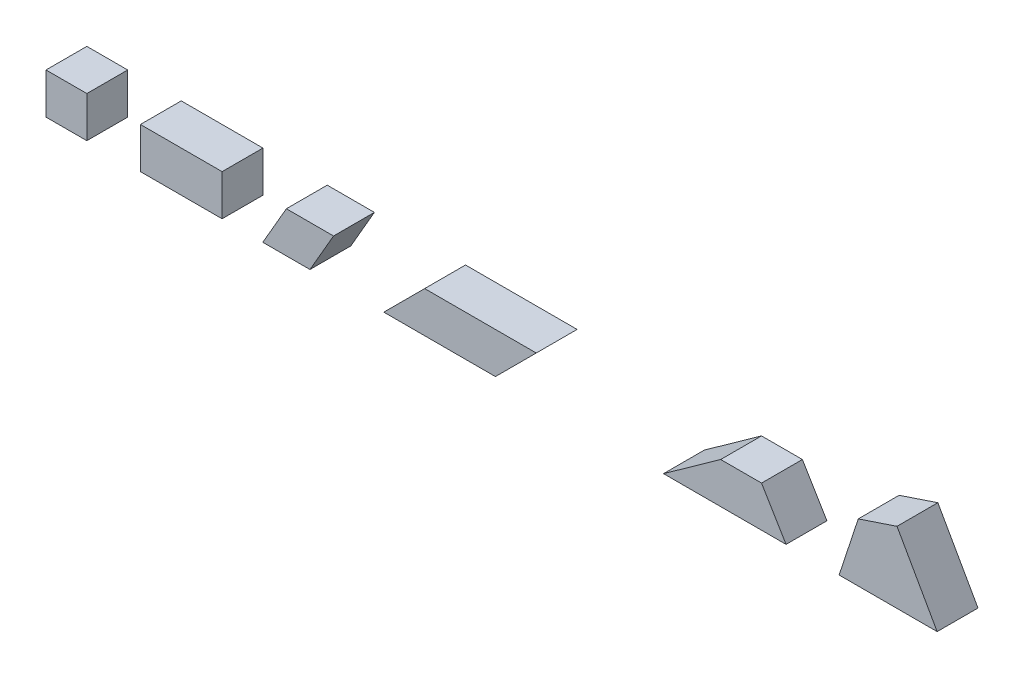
from build123d import *

# Parameters (mm, degrees)
EXTRUDE1_DEPTH   = 50
SKETCH1_W        = 50
SKETCH1_H        = 50
EXTRUDE1_2_DEPTH = 50
SKETCH1_W_2      = 100
EXTRUDE1_3_DEPTH = 50
EXTRUDE1_4_DEPTH = 50
EXTRUDE1_5_DEPTH = 50
EXTRUDE1_6_DEPTH = 50


with BuildPart() as part:
    # Sketch1 → Extrude1 (new body)
    with BuildSketch(Plane.XY):
        Polygon((265.351663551, 0), (323.08669047, 0), (351.95420393, 50), (294.219177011, 50), align=None)
    extrude(amount=EXTRUDE1_DEPTH)


with BuildPart() as body_2:
    # Sketch1 → Extrude1 2 (new body)
    with BuildSketch(Plane.XY):
        with Locations((25, 25)):
            Rectangle(SKETCH1_W, SKETCH1_H)
    extrude(amount=EXTRUDE1_2_DEPTH)


with BuildPart() as body_3:
    # Sketch1 → Extrude1 3 (new body)
    with BuildSketch(Plane.XY):
        with Locations((165.547306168, 25)):
            Rectangle(SKETCH1_W_2, SKETCH1_H)
    extrude(amount=EXTRUDE1_3_DEPTH)


with BuildPart() as body_4:
    # Sketch1 → Extrude1 4 (new body)
    with BuildSketch(Plane.XY):
        Polygon((413.472993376, 0), (550.075533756, 0), (600.075533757, 50), (463.472993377, 50), align=None)
    extrude(amount=EXTRUDE1_4_DEPTH)


with BuildPart() as body_5:
    # Sketch1 → Extrude1 5 (new body)
    with BuildSketch(Plane.XY):
        Polygon((755.828612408, 0), (905.828612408, 0), (875.828612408, 50), (825.828612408, 50), align=None)
    extrude(amount=EXTRUDE1_5_DEPTH)


with BuildPart() as body_6:
    # Sketch1 → Extrude1 6 (new body)
    with BuildSketch(Plane.XY):
        Polygon((970.760149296, 0), (1090.760149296, 0), (1041.619241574, 87.092888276), (994.197649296, 71.24383197), align=None)
    extrude(amount=EXTRUDE1_6_DEPTH)


solid = Compound([part.part, body_2.part, body_3.part, body_4.part, body_5.part, body_6.part])
